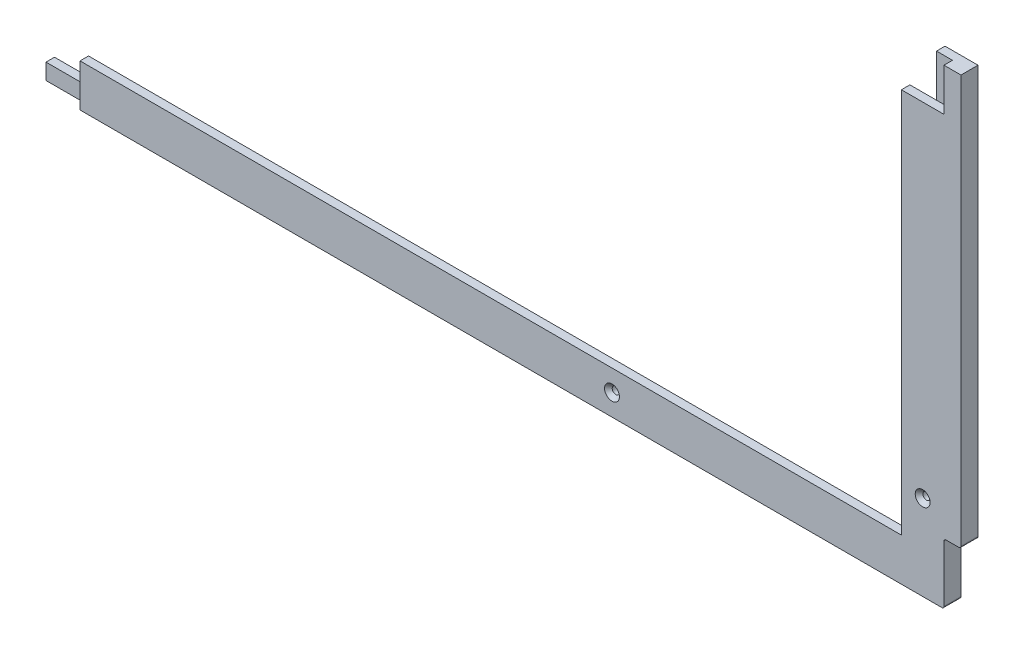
ISO-10303-21;
HEADER;
FILE_DESCRIPTION(('STEP AP214'),'2;1');
FILE_NAME('part.step','',(''),(''),'','','');
FILE_SCHEMA(('AUTOMOTIVE_DESIGN { 1 0 10303 214 1 1 1 1 }'));
ENDSEC;
DATA;
#1=APPLICATION_CONTEXT('core data for automotive mechanical design processes');
#2=APPLICATION_PROTOCOL_DEFINITION('international standard','automotive_design',2000,#1);
#3=PRODUCT_CONTEXT('',#1,'mechanical');
#4=PRODUCT('Part','Part','',(#3));
#5=PRODUCT_RELATED_PRODUCT_CATEGORY('part','',(#4));
#6=PRODUCT_DEFINITION_FORMATION('','',#4);
#7=PRODUCT_DEFINITION_CONTEXT('part definition',#1,'design');
#8=PRODUCT_DEFINITION('design','',#6,#7);
#9=PRODUCT_DEFINITION_SHAPE('','',#8);
#10=(LENGTH_UNIT() NAMED_UNIT(*) SI_UNIT(.MILLI.,.METRE.));
#11=(NAMED_UNIT(*) PLANE_ANGLE_UNIT() SI_UNIT($,.RADIAN.));
#12=(NAMED_UNIT(*) SI_UNIT($,.STERADIAN.) SOLID_ANGLE_UNIT());
#13=UNCERTAINTY_MEASURE_WITH_UNIT(LENGTH_MEASURE(1.E-05),#10,'distance_accuracy_value','');
#14=(GEOMETRIC_REPRESENTATION_CONTEXT(3) GLOBAL_UNCERTAINTY_ASSIGNED_CONTEXT((#13)) GLOBAL_UNIT_ASSIGNED_CONTEXT((#10,
#11,#12)) REPRESENTATION_CONTEXT('',''));
#15=CARTESIAN_POINT('',(0.,0.,0.));
#16=DIRECTION('',(0.,0.,1.));
#17=DIRECTION('',(1.,0.,0.));
#18=AXIS2_PLACEMENT_3D('',#15,#16,#17);
#19=CARTESIAN_POINT('',(0.,0.,8.));
#20=DIRECTION('',(0.,0.,-1.));
#21=DIRECTION('',(-1.,0.,0.));
#22=AXIS2_PLACEMENT_3D('',#19,#20,#21);
#23=PLANE('',#22);
#24=CARTESIAN_POINT('',(406.,-171.25,8.));
#25=DIRECTION('',(0.,0.,1.));
#26=DIRECTION('',(1.,0.,0.));
#27=AXIS2_PLACEMENT_3D('',#24,#25,#26);
#28=CIRCLE('',#27,3.5);
#29=CARTESIAN_POINT('',(409.5,-171.25,8.));
#30=VERTEX_POINT('',#29);
#31=EDGE_CURVE('E252',#30,#30,#28,.T.);
#32=ORIENTED_EDGE('',*,*,#31,.F.);
#33=EDGE_LOOP('',(#32));
#34=FACE_BOUND('',#33,.T.);
#35=CARTESIAN_POINT('',(260.,-201.25,8.));
#36=DIRECTION('',(0.,0.,1.));
#37=DIRECTION('',(1.,0.,0.));
#38=AXIS2_PLACEMENT_3D('',#35,#36,#37);
#39=CIRCLE('',#38,3.5);
#40=CARTESIAN_POINT('',(263.5,-201.25,8.));
#41=VERTEX_POINT('',#40);
#42=EDGE_CURVE('E245',#41,#41,#39,.T.);
#43=ORIENTED_EDGE('',*,*,#42,.F.);
#44=EDGE_LOOP('',(#43));
#45=FACE_BOUND('',#44,.T.);
#46=DIRECTION('',(1.,0.,0.));
#47=VECTOR('',#46,1.);
#48=CARTESIAN_POINT('',(416.,-182.75,8.00000000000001));
#49=LINE('',#48,#47);
#50=CARTESIAN_POINT('',(417.,-182.75,8.00000000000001));
#51=VERTEX_POINT('',#50);
#52=CARTESIAN_POINT('',(423.,-182.75,8.00000000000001));
#53=VERTEX_POINT('',#52);
#54=EDGE_CURVE('E326',#51,#53,#49,.T.);
#55=ORIENTED_EDGE('',*,*,#54,.T.);
#56=CARTESIAN_POINT('',(423.,-181.75,8.00000000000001));
#57=DIRECTION('',(0.,0.,-1.));
#58=DIRECTION('',(-1.,0.,0.));
#59=AXIS2_PLACEMENT_3D('',#56,#57,#58);
#60=CIRCLE('',#59,1.);
#61=CARTESIAN_POINT('',(424.,-181.75,8.00000000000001));
#62=VERTEX_POINT('',#61);
#63=EDGE_CURVE('E317',#53,#62,#60,.F.);
#64=ORIENTED_EDGE('',*,*,#63,.T.);
#65=DIRECTION('',(0.,1.,0.));
#66=VECTOR('',#65,1.);
#67=CARTESIAN_POINT('',(424.,10.,8.00000000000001));
#68=LINE('',#67,#66);
#69=CARTESIAN_POINT('',(424.,10.,8.00000000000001));
#70=VERTEX_POINT('',#69);
#71=EDGE_CURVE('E182',#62,#70,#68,.T.);
#72=ORIENTED_EDGE('',*,*,#71,.T.);
#73=DIRECTION('',(-1.,0.,0.));
#74=VECTOR('',#73,1.);
#75=CARTESIAN_POINT('',(416.,10.,8.00000000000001));
#76=LINE('',#75,#74);
#77=CARTESIAN_POINT('',(416.,10.,8.00000000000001));
#78=VERTEX_POINT('',#77);
#79=EDGE_CURVE('E179',#70,#78,#76,.T.);
#80=ORIENTED_EDGE('',*,*,#79,.T.);
#81=DIRECTION('',(0.,-1.,0.));
#82=VECTOR('',#81,1.);
#83=CARTESIAN_POINT('',(416.,10.,8.00000000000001));
#84=LINE('',#83,#82);
#85=CARTESIAN_POINT('',(416.,-10.,8.00000000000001));
#86=VERTEX_POINT('',#85);
#87=EDGE_CURVE('E194',#78,#86,#84,.T.);
#88=ORIENTED_EDGE('',*,*,#87,.T.);
#89=DIRECTION('',(-1.,0.,0.));
#90=VECTOR('',#89,1.);
#91=CARTESIAN_POINT('',(416.,-10.,7.99999999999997));
#92=LINE('',#91,#90);
#93=CARTESIAN_POINT('',(396.,-10.,7.99999999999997));
#94=VERTEX_POINT('',#93);
#95=EDGE_CURVE('E234',#86,#94,#92,.T.);
#96=ORIENTED_EDGE('',*,*,#95,.T.);
#97=DIRECTION('',(0.,1.,0.));
#98=VECTOR('',#97,1.);
#99=CARTESIAN_POINT('',(396.,-191.25,8.));
#100=LINE('',#99,#98);
#101=CARTESIAN_POINT('',(396.,-191.25,8.));
#102=VERTEX_POINT('',#101);
#103=EDGE_CURVE('E273',#102,#94,#100,.T.);
#104=ORIENTED_EDGE('',*,*,#103,.F.);
#105=DIRECTION('',(1.,0.,0.));
#106=VECTOR('',#105,1.);
#107=CARTESIAN_POINT('',(-396.,-191.25,8.));
#108=LINE('',#107,#106);
#109=CARTESIAN_POINT('',(9.99999999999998,-191.25,8.));
#110=VERTEX_POINT('',#109);
#111=EDGE_CURVE('E276',#110,#102,#108,.T.);
#112=ORIENTED_EDGE('',*,*,#111,.F.);
#113=DIRECTION('',(0.,1.,0.));
#114=VECTOR('',#113,1.);
#115=CARTESIAN_POINT('',(9.99999999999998,-211.25,8.));
#116=LINE('',#115,#114);
#117=CARTESIAN_POINT('',(9.99999999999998,-211.25,8.));
#118=VERTEX_POINT('',#117);
#119=EDGE_CURVE('E208',#118,#110,#116,.T.);
#120=ORIENTED_EDGE('',*,*,#119,.F.);
#121=DIRECTION('',(1.,0.,0.));
#122=VECTOR('',#121,1.);
#123=CARTESIAN_POINT('',(-416.,-211.25,8.));
#124=LINE('',#123,#122);
#125=CARTESIAN_POINT('',(415.,-211.25,8.));
#126=VERTEX_POINT('',#125);
#127=EDGE_CURVE('E284',#118,#126,#124,.T.);
#128=ORIENTED_EDGE('',*,*,#127,.T.);
#129=CARTESIAN_POINT('',(415.,-210.25,8.));
#130=DIRECTION('',(0.,0.,-1.));
#131=DIRECTION('',(-1.,0.,0.));
#132=AXIS2_PLACEMENT_3D('',#129,#130,#131);
#133=CIRCLE('',#132,1.);
#134=CARTESIAN_POINT('',(416.,-210.25,8.));
#135=VERTEX_POINT('',#134);
#136=EDGE_CURVE('E292',#126,#135,#133,.F.);
#137=ORIENTED_EDGE('',*,*,#136,.T.);
#138=DIRECTION('',(0.,1.,0.));
#139=VECTOR('',#138,1.);
#140=CARTESIAN_POINT('',(416.,-211.25,8.));
#141=LINE('',#140,#139);
#142=CARTESIAN_POINT('',(416.,-183.75,8.));
#143=VERTEX_POINT('',#142);
#144=EDGE_CURVE('E282',#135,#143,#141,.T.);
#145=ORIENTED_EDGE('',*,*,#144,.T.);
#146=CARTESIAN_POINT('',(417.,-183.75,8.00000000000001));
#147=DIRECTION('',(0.,0.,-1.));
#148=DIRECTION('',(-1.,0.,0.));
#149=AXIS2_PLACEMENT_3D('',#146,#147,#148);
#150=CIRCLE('',#149,1.);
#151=EDGE_CURVE('E11',#143,#51,#150,.T.);
#152=ORIENTED_EDGE('',*,*,#151,.T.);
#153=EDGE_LOOP('',(#55,#64,#72,#80,#88,#96,#104,#112,#120,#128,#137,#145,#152));
#154=FACE_BOUND('',#153,.T.);
#155=ADVANCED_FACE('F34',(#34,#45,#154),#23,.F.);
#156=CARTESIAN_POINT('',(396.,-191.25,8.));
#157=DIRECTION('',(-1.,0.,0.));
#158=DIRECTION('',(0.,0.,1.));
#159=AXIS2_PLACEMENT_3D('',#156,#157,#158);
#160=PLANE('',#159);
#161=ORIENTED_EDGE('',*,*,#103,.T.);
#162=DIRECTION('',(0.,0.,-1.));
#163=VECTOR('',#162,1.);
#164=CARTESIAN_POINT('',(396.,-10.,8.00000000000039));
#165=LINE('',#164,#163);
#166=CARTESIAN_POINT('',(396.,-10.,4.));
#167=VERTEX_POINT('',#166);
#168=EDGE_CURVE('E242',#94,#167,#165,.T.);
#169=ORIENTED_EDGE('',*,*,#168,.T.);
#170=DIRECTION('',(0.,-1.,0.));
#171=VECTOR('',#170,1.);
#172=CARTESIAN_POINT('',(396.,-191.25,4.));
#173=LINE('',#172,#171);
#174=CARTESIAN_POINT('',(396.,-191.25,4.));
#175=VERTEX_POINT('',#174);
#176=EDGE_CURVE('E271',#167,#175,#173,.T.);
#177=ORIENTED_EDGE('',*,*,#176,.T.);
#178=DIRECTION('',(0.,0.,-1.));
#179=VECTOR('',#178,1.);
#180=CARTESIAN_POINT('',(396.,-191.25,8.));
#181=LINE('',#180,#179);
#182=EDGE_CURVE('E278',#102,#175,#181,.T.);
#183=ORIENTED_EDGE('',*,*,#182,.F.);
#184=EDGE_LOOP('',(#161,#169,#177,#183));
#185=FACE_BOUND('',#184,.T.);
#186=ADVANCED_FACE('F342',(#185),#160,.T.);
#187=CARTESIAN_POINT('',(0.,0.,0.));
#188=DIRECTION('',(0.,0.,-1.));
#189=DIRECTION('',(-1.,0.,0.));
#190=AXIS2_PLACEMENT_3D('',#187,#188,#189);
#191=PLANE('',#190);
#192=DIRECTION('',(0.,-1.,0.));
#193=VECTOR('',#192,1.);
#194=CARTESIAN_POINT('',(424.,10.,0.));
#195=LINE('',#194,#193);
#196=CARTESIAN_POINT('',(424.,10.,0.));
#197=VERTEX_POINT('',#196);
#198=CARTESIAN_POINT('',(424.,-181.75,0.));
#199=VERTEX_POINT('',#198);
#200=EDGE_CURVE('E166',#197,#199,#195,.T.);
#201=ORIENTED_EDGE('',*,*,#200,.T.);
#202=CARTESIAN_POINT('',(423.,-181.75,0.));
#203=DIRECTION('',(0.,0.,-1.));
#204=DIRECTION('',(-1.,0.,0.));
#205=AXIS2_PLACEMENT_3D('',#202,#203,#204);
#206=CIRCLE('',#205,1.);
#207=CARTESIAN_POINT('',(423.,-182.75,0.));
#208=VERTEX_POINT('',#207);
#209=EDGE_CURVE('E311',#199,#208,#206,.T.);
#210=ORIENTED_EDGE('',*,*,#209,.T.);
#211=DIRECTION('',(-1.,0.,0.));
#212=VECTOR('',#211,1.);
#213=CARTESIAN_POINT('',(416.,-182.75,0.));
#214=LINE('',#213,#212);
#215=CARTESIAN_POINT('',(417.,-182.75,0.));
#216=VERTEX_POINT('',#215);
#217=EDGE_CURVE('E189',#208,#216,#214,.T.);
#218=ORIENTED_EDGE('',*,*,#217,.T.);
#219=CARTESIAN_POINT('',(417.,-183.75,0.));
#220=DIRECTION('',(0.,0.,-1.));
#221=DIRECTION('',(-1.,0.,0.));
#222=AXIS2_PLACEMENT_3D('',#219,#220,#221);
#223=CIRCLE('',#222,1.);
#224=CARTESIAN_POINT('',(416.,-183.75,0.));
#225=VERTEX_POINT('',#224);
#226=EDGE_CURVE('E42',#216,#225,#223,.F.);
#227=ORIENTED_EDGE('',*,*,#226,.T.);
#228=DIRECTION('',(0.,1.,0.));
#229=VECTOR('',#228,1.);
#230=CARTESIAN_POINT('',(416.,-211.25,0.));
#231=LINE('',#230,#229);
#232=CARTESIAN_POINT('',(416.,-210.25,0.));
#233=VERTEX_POINT('',#232);
#234=EDGE_CURVE('E281',#233,#225,#231,.T.);
#235=ORIENTED_EDGE('',*,*,#234,.F.);
#236=CARTESIAN_POINT('',(415.,-210.25,0.));
#237=DIRECTION('',(0.,0.,-1.));
#238=DIRECTION('',(-1.,0.,0.));
#239=AXIS2_PLACEMENT_3D('',#236,#237,#238);
#240=CIRCLE('',#239,1.);
#241=CARTESIAN_POINT('',(415.,-211.25,0.));
#242=VERTEX_POINT('',#241);
#243=EDGE_CURVE('E287',#233,#242,#240,.T.);
#244=ORIENTED_EDGE('',*,*,#243,.T.);
#245=DIRECTION('',(1.,0.,0.));
#246=VECTOR('',#245,1.);
#247=CARTESIAN_POINT('',(-416.,-211.25,0.));
#248=LINE('',#247,#246);
#249=CARTESIAN_POINT('',(-10.,-211.25,0.));
#250=VERTEX_POINT('',#249);
#251=EDGE_CURVE('E285',#250,#242,#248,.T.);
#252=ORIENTED_EDGE('',*,*,#251,.F.);
#253=DIRECTION('',(0.,1.,0.));
#254=VECTOR('',#253,1.);
#255=CARTESIAN_POINT('',(-10.,-211.25,0.));
#256=LINE('',#255,#254);
#257=CARTESIAN_POINT('',(-10.,-203.75,0.));
#258=VERTEX_POINT('',#257);
#259=EDGE_CURVE('E209',#250,#258,#256,.T.);
#260=ORIENTED_EDGE('',*,*,#259,.T.);
#261=DIRECTION('',(-1.,0.,0.));
#262=VECTOR('',#261,1.);
#263=CARTESIAN_POINT('',(408.5,-203.75,0.));
#264=LINE('',#263,#262);
#265=CARTESIAN_POINT('',(408.5,-203.75,0.));
#266=VERTEX_POINT('',#265);
#267=EDGE_CURVE('E262',#266,#258,#264,.T.);
#268=ORIENTED_EDGE('',*,*,#267,.F.);
#269=DIRECTION('',(0.,-1.,0.));
#270=VECTOR('',#269,1.);
#271=CARTESIAN_POINT('',(408.5,203.75,0.));
#272=LINE('',#271,#270);
#273=CARTESIAN_POINT('',(408.5,10.,0.));
#274=VERTEX_POINT('',#273);
#275=EDGE_CURVE('E168',#274,#266,#272,.T.);
#276=ORIENTED_EDGE('',*,*,#275,.F.);
#277=DIRECTION('',(-1.,0.,0.));
#278=VECTOR('',#277,1.);
#279=CARTESIAN_POINT('',(416.,10.,0.));
#280=LINE('',#279,#278);
#281=EDGE_CURVE('E162',#197,#274,#280,.T.);
#282=ORIENTED_EDGE('',*,*,#281,.F.);
#283=EDGE_LOOP('',(#201,#210,#218,#227,#235,#244,#252,#260,#268,#276,#282));
#284=FACE_BOUND('',#283,.T.);
#285=ADVANCED_FACE('F164',(#284),#191,.T.);
#286=CARTESIAN_POINT('',(416.,-211.25,8.));
#287=DIRECTION('',(-1.,0.,0.));
#288=DIRECTION('',(0.,0.,1.));
#289=AXIS2_PLACEMENT_3D('',#286,#287,#288);
#290=PLANE('',#289);
#291=ORIENTED_EDGE('',*,*,#234,.T.);
#292=DIRECTION('',(0.,0.,-1.));
#293=VECTOR('',#292,1.);
#294=CARTESIAN_POINT('',(416.,-183.75,8.));
#295=LINE('',#294,#293);
#296=EDGE_CURVE('E49',#225,#143,#295,.F.);
#297=ORIENTED_EDGE('',*,*,#296,.T.);
#298=ORIENTED_EDGE('',*,*,#144,.F.);
#299=DIRECTION('',(0.,0.,-1.));
#300=VECTOR('',#299,1.);
#301=CARTESIAN_POINT('',(416.,-210.25,8.));
#302=LINE('',#301,#300);
#303=EDGE_CURVE('E297',#135,#233,#302,.T.);
#304=ORIENTED_EDGE('',*,*,#303,.T.);
#305=EDGE_LOOP('',(#291,#297,#298,#304));
#306=FACE_BOUND('',#305,.T.);
#307=ADVANCED_FACE('F322',(#306),#290,.F.);
#308=CARTESIAN_POINT('',(408.5,203.75,4.));
#309=DIRECTION('',(1.,0.,0.));
#310=DIRECTION('',(0.,1.,0.));
#311=AXIS2_PLACEMENT_3D('',#308,#309,#310);
#312=PLANE('',#311);
#313=DIRECTION('',(0.,0.,1.));
#314=VECTOR('',#313,1.);
#315=CARTESIAN_POINT('',(408.5,10.,3.9999999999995));
#316=LINE('',#315,#314);
#317=CARTESIAN_POINT('',(408.5,10.,4.));
#318=VERTEX_POINT('',#317);
#319=EDGE_CURVE('E240',#274,#318,#316,.T.);
#320=ORIENTED_EDGE('',*,*,#319,.F.);
#321=ORIENTED_EDGE('',*,*,#275,.T.);
#322=DIRECTION('',(0.,0.,-1.));
#323=VECTOR('',#322,1.);
#324=CARTESIAN_POINT('',(408.5,-203.75,4.));
#325=LINE('',#324,#323);
#326=CARTESIAN_POINT('',(408.5,-203.75,4.));
#327=VERTEX_POINT('',#326);
#328=EDGE_CURVE('E265',#327,#266,#325,.T.);
#329=ORIENTED_EDGE('',*,*,#328,.F.);
#330=DIRECTION('',(0.,-1.,0.));
#331=VECTOR('',#330,1.);
#332=CARTESIAN_POINT('',(408.5,203.75,4.));
#333=LINE('',#332,#331);
#334=CARTESIAN_POINT('',(408.5,-10.,4.));
#335=VERTEX_POINT('',#334);
#336=EDGE_CURVE('E259',#335,#327,#333,.T.);
#337=ORIENTED_EDGE('',*,*,#336,.F.);
#338=DIRECTION('',(0.,-1.,0.));
#339=VECTOR('',#338,1.);
#340=CARTESIAN_POINT('',(408.5,203.75,4.));
#341=LINE('',#340,#339);
#342=EDGE_CURVE('E237',#318,#335,#341,.T.);
#343=ORIENTED_EDGE('',*,*,#342,.F.);
#344=EDGE_LOOP('',(#320,#321,#329,#337,#343));
#345=FACE_BOUND('',#344,.T.);
#346=ADVANCED_FACE('F363',(#345),#312,.F.);
#347=CARTESIAN_POINT('',(0.,0.,4.));
#348=DIRECTION('',(0.,0.,-1.));
#349=DIRECTION('',(-1.,0.,0.));
#350=AXIS2_PLACEMENT_3D('',#347,#348,#349);
#351=PLANE('',#350);
#352=DIRECTION('',(0.,1.,0.));
#353=VECTOR('',#352,1.);
#354=CARTESIAN_POINT('',(10.,-211.25,4.));
#355=LINE('',#354,#353);
#356=CARTESIAN_POINT('',(10.0000000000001,-203.75,4.));
#357=VERTEX_POINT('',#356);
#358=CARTESIAN_POINT('',(10.,-191.25,4.));
#359=VERTEX_POINT('',#358);
#360=EDGE_CURVE('E218',#357,#359,#355,.T.);
#361=ORIENTED_EDGE('',*,*,#360,.T.);
#362=DIRECTION('',(-1.,0.,0.));
#363=VECTOR('',#362,1.);
#364=CARTESIAN_POINT('',(-396.,-191.25,4.));
#365=LINE('',#364,#363);
#366=EDGE_CURVE('E300',#175,#359,#365,.T.);
#367=ORIENTED_EDGE('',*,*,#366,.F.);
#368=ORIENTED_EDGE('',*,*,#176,.F.);
#369=DIRECTION('',(-1.,0.,0.));
#370=VECTOR('',#369,1.);
#371=CARTESIAN_POINT('',(416.,-10.,4.));
#372=LINE('',#371,#370);
#373=EDGE_CURVE('E231',#335,#167,#372,.T.);
#374=ORIENTED_EDGE('',*,*,#373,.F.);
#375=ORIENTED_EDGE('',*,*,#336,.T.);
#376=DIRECTION('',(-1.,0.,0.));
#377=VECTOR('',#376,1.);
#378=CARTESIAN_POINT('',(408.5,-203.75,4.));
#379=LINE('',#378,#377);
#380=EDGE_CURVE('E261',#327,#357,#379,.T.);
#381=ORIENTED_EDGE('',*,*,#380,.T.);
#382=EDGE_LOOP('',(#361,#367,#368,#374,#375,#381));
#383=FACE_BOUND('',#382,.T.);
#384=CARTESIAN_POINT('',(260.,-201.25,4.));
#385=DIRECTION('',(0.,0.,-1.));
#386=DIRECTION('',(-1.,0.,0.));
#387=AXIS2_PLACEMENT_3D('',#384,#385,#386);
#388=CIRCLE('',#387,1.69999999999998);
#389=CARTESIAN_POINT('',(258.3,-201.25,4.));
#390=VERTEX_POINT('',#389);
#391=EDGE_CURVE('E251',#390,#390,#388,.T.);
#392=ORIENTED_EDGE('',*,*,#391,.F.);
#393=EDGE_LOOP('',(#392));
#394=FACE_BOUND('',#393,.T.);
#395=CARTESIAN_POINT('',(406.,-171.25,4.));
#396=DIRECTION('',(0.,0.,-1.));
#397=DIRECTION('',(-1.,0.,0.));
#398=AXIS2_PLACEMENT_3D('',#395,#396,#397);
#399=CIRCLE('',#398,1.69999999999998);
#400=CARTESIAN_POINT('',(404.3,-171.25,4.));
#401=VERTEX_POINT('',#400);
#402=EDGE_CURVE('E258',#401,#401,#399,.T.);
#403=ORIENTED_EDGE('',*,*,#402,.F.);
#404=EDGE_LOOP('',(#403));
#405=FACE_BOUND('',#404,.T.);
#406=ADVANCED_FACE('F407',(#383,#394,#405),#351,.T.);
#407=CARTESIAN_POINT('',(-396.,-191.25,8.));
#408=DIRECTION('',(0.,1.,0.));
#409=DIRECTION('',(0.,0.,1.));
#410=AXIS2_PLACEMENT_3D('',#407,#408,#409);
#411=PLANE('',#410);
#412=DIRECTION('',(0.,0.,-1.));
#413=VECTOR('',#412,1.);
#414=CARTESIAN_POINT('',(10.,-191.25,8.00000000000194));
#415=LINE('',#414,#413);
#416=EDGE_CURVE('E222',#110,#359,#415,.T.);
#417=ORIENTED_EDGE('',*,*,#416,.F.);
#418=ORIENTED_EDGE('',*,*,#111,.T.);
#419=ORIENTED_EDGE('',*,*,#182,.T.);
#420=ORIENTED_EDGE('',*,*,#366,.T.);
#421=EDGE_LOOP('',(#417,#418,#419,#420));
#422=FACE_BOUND('',#421,.T.);
#423=ADVANCED_FACE('F360',(#422),#411,.T.);
#424=CARTESIAN_POINT('',(-416.,-211.25,8.));
#425=DIRECTION('',(0.,1.,0.));
#426=DIRECTION('',(0.,0.,1.));
#427=AXIS2_PLACEMENT_3D('',#424,#425,#426);
#428=PLANE('',#427);
#429=DIRECTION('',(-1.,0.,0.));
#430=VECTOR('',#429,1.);
#431=CARTESIAN_POINT('',(-10.,-211.25,4.));
#432=LINE('',#431,#430);
#433=CARTESIAN_POINT('',(10.,-211.25,4.));
#434=VERTEX_POINT('',#433);
#435=CARTESIAN_POINT('',(-10.,-211.25,4.));
#436=VERTEX_POINT('',#435);
#437=EDGE_CURVE('E202',#434,#436,#432,.T.);
#438=ORIENTED_EDGE('',*,*,#437,.T.);
#439=DIRECTION('',(0.,0.,-1.));
#440=VECTOR('',#439,1.);
#441=CARTESIAN_POINT('',(-10.,-211.25,0.));
#442=LINE('',#441,#440);
#443=EDGE_CURVE('E205',#436,#250,#442,.T.);
#444=ORIENTED_EDGE('',*,*,#443,.T.);
#445=ORIENTED_EDGE('',*,*,#251,.T.);
#446=DIRECTION('',(0.,0.,-1.));
#447=VECTOR('',#446,1.);
#448=CARTESIAN_POINT('',(415.,-211.25,8.));
#449=LINE('',#448,#447);
#450=EDGE_CURVE('E294',#242,#126,#449,.F.);
#451=ORIENTED_EDGE('',*,*,#450,.T.);
#452=ORIENTED_EDGE('',*,*,#127,.F.);
#453=DIRECTION('',(0.,0.,-1.));
#454=VECTOR('',#453,1.);
#455=CARTESIAN_POINT('',(10.,-211.25,4.));
#456=LINE('',#455,#454);
#457=EDGE_CURVE('E199',#118,#434,#456,.T.);
#458=ORIENTED_EDGE('',*,*,#457,.T.);
#459=EDGE_LOOP('',(#438,#444,#445,#451,#452,#458));
#460=FACE_BOUND('',#459,.T.);
#461=ADVANCED_FACE('F356',(#460),#428,.F.);
#462=CARTESIAN_POINT('',(415.,-210.25,8.));
#463=DIRECTION('',(0.,0.,-1.));
#464=DIRECTION('',(-1.,0.,0.));
#465=AXIS2_PLACEMENT_3D('',#462,#463,#464);
#466=CYLINDRICAL_SURFACE('',#465,1.);
#467=ORIENTED_EDGE('',*,*,#136,.F.);
#468=ORIENTED_EDGE('',*,*,#450,.F.);
#469=ORIENTED_EDGE('',*,*,#243,.F.);
#470=ORIENTED_EDGE('',*,*,#303,.F.);
#471=EDGE_LOOP('',(#467,#468,#469,#470));
#472=FACE_BOUND('',#471,.T.);
#473=ADVANCED_FACE('F359',(#472),#466,.T.);
#474=CARTESIAN_POINT('',(408.5,-203.75,4.));
#475=DIRECTION('',(0.,-1.,0.));
#476=DIRECTION('',(0.,0.,-1.));
#477=AXIS2_PLACEMENT_3D('',#474,#475,#476);
#478=PLANE('',#477);
#479=ORIENTED_EDGE('',*,*,#267,.T.);
#480=DIRECTION('',(0.,0.,1.));
#481=VECTOR('',#480,1.);
#482=CARTESIAN_POINT('',(-10.,-203.75,4.00000000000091));
#483=LINE('',#482,#481);
#484=CARTESIAN_POINT('',(-10.,-203.75,4.));
#485=VERTEX_POINT('',#484);
#486=EDGE_CURVE('E303',#258,#485,#483,.T.);
#487=ORIENTED_EDGE('',*,*,#486,.T.);
#488=DIRECTION('',(1.,0.,0.));
#489=VECTOR('',#488,1.);
#490=CARTESIAN_POINT('',(408.5,-203.75,4.));
#491=LINE('',#490,#489);
#492=EDGE_CURVE('E212',#485,#357,#491,.T.);
#493=ORIENTED_EDGE('',*,*,#492,.T.);
#494=ORIENTED_EDGE('',*,*,#380,.F.);
#495=ORIENTED_EDGE('',*,*,#328,.T.);
#496=EDGE_LOOP('',(#479,#487,#493,#494,#495));
#497=FACE_BOUND('',#496,.T.);
#498=ADVANCED_FACE('F365',(#497),#478,.F.);
#499=CARTESIAN_POINT('',(406.,-171.25,8.));
#500=DIRECTION('',(0.,0.,1.));
#501=DIRECTION('',(1.,0.,0.));
#502=AXIS2_PLACEMENT_3D('',#499,#500,#501);
#503=CYLINDRICAL_SURFACE('',#502,1.69999999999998);
#504=ORIENTED_EDGE('',*,*,#402,.T.);
#505=EDGE_LOOP('',(#504));
#506=FACE_BOUND('',#505,.T.);
#507=CARTESIAN_POINT('',(406.,-171.25,6.2));
#508=DIRECTION('',(0.,0.,1.));
#509=DIRECTION('',(1.,0.,0.));
#510=AXIS2_PLACEMENT_3D('',#507,#508,#509);
#511=CIRCLE('',#510,1.69999999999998);
#512=CARTESIAN_POINT('',(407.7,-171.25,6.2));
#513=VERTEX_POINT('',#512);
#514=EDGE_CURVE('E255',#513,#513,#511,.T.);
#515=ORIENTED_EDGE('',*,*,#514,.T.);
#516=EDGE_LOOP('',(#515));
#517=FACE_BOUND('',#516,.T.);
#518=ADVANCED_FACE('F370',(#506,#517),#503,.F.);
#519=CARTESIAN_POINT('',(406.,-171.25,8.));
#520=DIRECTION('',(0.,0.,1.));
#521=DIRECTION('',(1.,0.,0.));
#522=AXIS2_PLACEMENT_3D('',#519,#520,#521);
#523=CONICAL_SURFACE('',#522,3.5,0.785398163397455);
#524=ORIENTED_EDGE('',*,*,#514,.F.);
#525=EDGE_LOOP('',(#524));
#526=FACE_BOUND('',#525,.T.);
#527=ORIENTED_EDGE('',*,*,#31,.T.);
#528=EDGE_LOOP('',(#527));
#529=FACE_BOUND('',#528,.T.);
#530=ADVANCED_FACE('F417',(#526,#529),#523,.F.);
#531=CARTESIAN_POINT('',(260.,-201.25,8.));
#532=DIRECTION('',(0.,0.,1.));
#533=DIRECTION('',(1.,0.,0.));
#534=AXIS2_PLACEMENT_3D('',#531,#532,#533);
#535=CYLINDRICAL_SURFACE('',#534,1.69999999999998);
#536=ORIENTED_EDGE('',*,*,#391,.T.);
#537=EDGE_LOOP('',(#536));
#538=FACE_BOUND('',#537,.T.);
#539=CARTESIAN_POINT('',(260.,-201.25,6.2));
#540=DIRECTION('',(0.,0.,1.));
#541=DIRECTION('',(1.,0.,0.));
#542=AXIS2_PLACEMENT_3D('',#539,#540,#541);
#543=CIRCLE('',#542,1.69999999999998);
#544=CARTESIAN_POINT('',(261.7,-201.25,6.2));
#545=VERTEX_POINT('',#544);
#546=EDGE_CURVE('E248',#545,#545,#543,.T.);
#547=ORIENTED_EDGE('',*,*,#546,.T.);
#548=EDGE_LOOP('',(#547));
#549=FACE_BOUND('',#548,.T.);
#550=ADVANCED_FACE('F423',(#538,#549),#535,.F.);
#551=CARTESIAN_POINT('',(260.,-201.25,8.));
#552=DIRECTION('',(0.,0.,1.));
#553=DIRECTION('',(1.,0.,0.));
#554=AXIS2_PLACEMENT_3D('',#551,#552,#553);
#555=CONICAL_SURFACE('',#554,3.5,0.785398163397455);
#556=ORIENTED_EDGE('',*,*,#546,.F.);
#557=EDGE_LOOP('',(#556));
#558=FACE_BOUND('',#557,.T.);
#559=ORIENTED_EDGE('',*,*,#42,.T.);
#560=EDGE_LOOP('',(#559));
#561=FACE_BOUND('',#560,.T.);
#562=ADVANCED_FACE('F428',(#558,#561),#555,.F.);
#563=CARTESIAN_POINT('',(416.,10.,4.));
#564=DIRECTION('',(0.,1.,0.));
#565=DIRECTION('',(0.,0.,1.));
#566=AXIS2_PLACEMENT_3D('',#563,#564,#565);
#567=PLANE('',#566);
#568=ORIENTED_EDGE('',*,*,#319,.T.);
#569=DIRECTION('',(-1.,0.,0.));
#570=VECTOR('',#569,1.);
#571=CARTESIAN_POINT('',(416.,10.,4.));
#572=LINE('',#571,#570);
#573=CARTESIAN_POINT('',(416.,10.,4.));
#574=VERTEX_POINT('',#573);
#575=EDGE_CURVE('E171',#574,#318,#572,.T.);
#576=ORIENTED_EDGE('',*,*,#575,.F.);
#577=DIRECTION('',(0.,0.,-1.));
#578=VECTOR('',#577,1.);
#579=CARTESIAN_POINT('',(416.,10.,200.915946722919));
#580=LINE('',#579,#578);
#581=EDGE_CURVE('E183',#78,#574,#580,.T.);
#582=ORIENTED_EDGE('',*,*,#581,.F.);
#583=ORIENTED_EDGE('',*,*,#79,.F.);
#584=DIRECTION('',(0.,0.,-1.));
#585=VECTOR('',#584,1.);
#586=CARTESIAN_POINT('',(424.,10.,200.915946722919));
#587=LINE('',#586,#585);
#588=EDGE_CURVE('E176',#70,#197,#587,.T.);
#589=ORIENTED_EDGE('',*,*,#588,.T.);
#590=ORIENTED_EDGE('',*,*,#281,.T.);
#591=EDGE_LOOP('',(#568,#576,#582,#583,#589,#590));
#592=FACE_BOUND('',#591,.T.);
#593=ADVANCED_FACE('F177',(#592),#567,.T.);
#594=CARTESIAN_POINT('',(416.,-10.,4.));
#595=DIRECTION('',(0.,0.,1.));
#596=DIRECTION('',(1.,0.,0.));
#597=AXIS2_PLACEMENT_3D('',#594,#595,#596);
#598=PLANE('',#597);
#599=ORIENTED_EDGE('',*,*,#342,.T.);
#600=CARTESIAN_POINT('',(416.,-10.,4.));
#601=VERTEX_POINT('',#600);
#602=EDGE_CURVE('E232',#601,#335,#372,.T.);
#603=ORIENTED_EDGE('',*,*,#602,.F.);
#604=DIRECTION('',(0.,1.,0.));
#605=VECTOR('',#604,1.);
#606=CARTESIAN_POINT('',(416.,-10.,4.));
#607=LINE('',#606,#605);
#608=EDGE_CURVE('E172',#601,#574,#607,.T.);
#609=ORIENTED_EDGE('',*,*,#608,.T.);
#610=ORIENTED_EDGE('',*,*,#575,.T.);
#611=EDGE_LOOP('',(#599,#603,#609,#610));
#612=FACE_BOUND('',#611,.T.);
#613=ADVANCED_FACE('F388',(#612),#598,.T.);
#614=CARTESIAN_POINT('',(416.,-10.,7.99999999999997));
#615=DIRECTION('',(0.,1.,0.));
#616=DIRECTION('',(0.,0.,1.));
#617=AXIS2_PLACEMENT_3D('',#614,#615,#616);
#618=PLANE('',#617);
#619=ORIENTED_EDGE('',*,*,#95,.F.);
#620=DIRECTION('',(0.,0.,-1.));
#621=VECTOR('',#620,1.);
#622=CARTESIAN_POINT('',(416.,-10.,7.99999999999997));
#623=LINE('',#622,#621);
#624=EDGE_CURVE('E224',#86,#601,#623,.T.);
#625=ORIENTED_EDGE('',*,*,#624,.T.);
#626=ORIENTED_EDGE('',*,*,#602,.T.);
#627=ORIENTED_EDGE('',*,*,#373,.T.);
#628=ORIENTED_EDGE('',*,*,#168,.F.);
#629=EDGE_LOOP('',(#619,#625,#626,#627,#628));
#630=FACE_BOUND('',#629,.T.);
#631=ADVANCED_FACE('F395',(#630),#618,.T.);
#632=CARTESIAN_POINT('',(-10.,-211.25,0.));
#633=DIRECTION('',(1.,0.,0.));
#634=DIRECTION('',(0.,0.,-1.));
#635=AXIS2_PLACEMENT_3D('',#632,#633,#634);
#636=PLANE('',#635);
#637=ORIENTED_EDGE('',*,*,#259,.F.);
#638=ORIENTED_EDGE('',*,*,#443,.F.);
#639=DIRECTION('',(0.,1.,0.));
#640=VECTOR('',#639,1.);
#641=CARTESIAN_POINT('',(-10.,-211.25,4.));
#642=LINE('',#641,#640);
#643=EDGE_CURVE('E213',#436,#485,#642,.T.);
#644=ORIENTED_EDGE('',*,*,#643,.T.);
#645=ORIENTED_EDGE('',*,*,#486,.F.);
#646=EDGE_LOOP('',(#637,#638,#644,#645));
#647=FACE_BOUND('',#646,.T.);
#648=ADVANCED_FACE('F456',(#647),#636,.F.);
#649=CARTESIAN_POINT('',(-10.,-211.25,4.));
#650=DIRECTION('',(0.,0.,-1.));
#651=DIRECTION('',(-1.,0.,0.));
#652=AXIS2_PLACEMENT_3D('',#649,#650,#651);
#653=PLANE('',#652);
#654=ORIENTED_EDGE('',*,*,#643,.F.);
#655=ORIENTED_EDGE('',*,*,#437,.F.);
#656=EDGE_CURVE('E216',#434,#357,#355,.T.);
#657=ORIENTED_EDGE('',*,*,#656,.T.);
#658=ORIENTED_EDGE('',*,*,#492,.F.);
#659=EDGE_LOOP('',(#654,#655,#657,#658));
#660=FACE_BOUND('',#659,.T.);
#661=ADVANCED_FACE('F461',(#660),#653,.F.);
#662=CARTESIAN_POINT('',(10.,-211.25,4.));
#663=DIRECTION('',(1.,0.,0.));
#664=DIRECTION('',(0.,0.,-1.));
#665=AXIS2_PLACEMENT_3D('',#662,#663,#664);
#666=PLANE('',#665);
#667=ORIENTED_EDGE('',*,*,#416,.T.);
#668=ORIENTED_EDGE('',*,*,#360,.F.);
#669=ORIENTED_EDGE('',*,*,#656,.F.);
#670=ORIENTED_EDGE('',*,*,#457,.F.);
#671=ORIENTED_EDGE('',*,*,#119,.T.);
#672=EDGE_LOOP('',(#667,#668,#669,#670,#671));
#673=FACE_BOUND('',#672,.T.);
#674=ADVANCED_FACE('F405',(#673),#666,.F.);
#675=CARTESIAN_POINT('',(416.,10.,200.915946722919));
#676=DIRECTION('',(-1.,0.,0.));
#677=DIRECTION('',(0.,0.,1.));
#678=AXIS2_PLACEMENT_3D('',#675,#676,#677);
#679=PLANE('',#678);
#680=ORIENTED_EDGE('',*,*,#581,.T.);
#681=ORIENTED_EDGE('',*,*,#608,.F.);
#682=ORIENTED_EDGE('',*,*,#624,.F.);
#683=ORIENTED_EDGE('',*,*,#87,.F.);
#684=EDGE_LOOP('',(#680,#681,#682,#683));
#685=FACE_BOUND('',#684,.T.);
#686=ADVANCED_FACE('F392',(#685),#679,.T.);
#687=CARTESIAN_POINT('',(416.,-182.75,200.915946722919));
#688=DIRECTION('',(0.,-1.,0.));
#689=DIRECTION('',(0.,0.,-1.));
#690=AXIS2_PLACEMENT_3D('',#687,#688,#689);
#691=PLANE('',#690);
#692=ORIENTED_EDGE('',*,*,#217,.F.);
#693=DIRECTION('',(0.,0.,-1.));
#694=VECTOR('',#693,1.);
#695=CARTESIAN_POINT('',(423.,-182.75,200.915946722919));
#696=LINE('',#695,#694);
#697=EDGE_CURVE('E57',#208,#53,#696,.F.);
#698=ORIENTED_EDGE('',*,*,#697,.T.);
#699=ORIENTED_EDGE('',*,*,#54,.F.);
#700=DIRECTION('',(0.,0.,-1.));
#701=VECTOR('',#700,1.);
#702=CARTESIAN_POINT('',(417.,-182.75,200.915946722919));
#703=LINE('',#702,#701);
#704=EDGE_CURVE('E313',#51,#216,#703,.T.);
#705=ORIENTED_EDGE('',*,*,#704,.T.);
#706=EDGE_LOOP('',(#692,#698,#699,#705));
#707=FACE_BOUND('',#706,.T.);
#708=ADVANCED_FACE('F328',(#707),#691,.T.);
#709=CARTESIAN_POINT('',(424.,10.,200.915946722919));
#710=DIRECTION('',(1.,0.,0.));
#711=DIRECTION('',(0.,0.,-1.));
#712=AXIS2_PLACEMENT_3D('',#709,#710,#711);
#713=PLANE('',#712);
#714=ORIENTED_EDGE('',*,*,#71,.F.);
#715=DIRECTION('',(0.,0.,-1.));
#716=VECTOR('',#715,1.);
#717=CARTESIAN_POINT('',(424.,-181.75,200.915946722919));
#718=LINE('',#717,#716);
#719=EDGE_CURVE('E188',#62,#199,#718,.T.);
#720=ORIENTED_EDGE('',*,*,#719,.T.);
#721=ORIENTED_EDGE('',*,*,#200,.F.);
#722=ORIENTED_EDGE('',*,*,#588,.F.);
#723=EDGE_LOOP('',(#714,#720,#721,#722));
#724=FACE_BOUND('',#723,.T.);
#725=ADVANCED_FACE('F186',(#724),#713,.T.);
#726=CARTESIAN_POINT('',(423.,-181.75,200.915946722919));
#727=DIRECTION('',(0.,0.,-1.));
#728=DIRECTION('',(-1.,0.,0.));
#729=AXIS2_PLACEMENT_3D('',#726,#727,#728);
#730=CYLINDRICAL_SURFACE('',#729,1.);
#731=ORIENTED_EDGE('',*,*,#63,.F.);
#732=ORIENTED_EDGE('',*,*,#697,.F.);
#733=ORIENTED_EDGE('',*,*,#209,.F.);
#734=ORIENTED_EDGE('',*,*,#719,.F.);
#735=EDGE_LOOP('',(#731,#732,#733,#734));
#736=FACE_BOUND('',#735,.T.);
#737=ADVANCED_FACE('F333',(#736),#730,.T.);
#738=CARTESIAN_POINT('',(417.,-183.75,200.915946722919));
#739=DIRECTION('',(0.,0.,-1.));
#740=DIRECTION('',(-1.,0.,0.));
#741=AXIS2_PLACEMENT_3D('',#738,#739,#740);
#742=CYLINDRICAL_SURFACE('',#741,1.);
#743=ORIENTED_EDGE('',*,*,#151,.F.);
#744=ORIENTED_EDGE('',*,*,#296,.F.);
#745=ORIENTED_EDGE('',*,*,#226,.F.);
#746=ORIENTED_EDGE('',*,*,#704,.F.);
#747=EDGE_LOOP('',(#743,#744,#745,#746));
#748=FACE_BOUND('',#747,.T.);
#749=ADVANCED_FACE('F36',(#748),#742,.F.);
#750=CLOSED_SHELL('',(#155,#186,#285,#307,#346,#406,#423,#461,#473,#498,#518,#530,#550,#562,
#593,#613,#631,#648,#661,#674,#686,#708,#725,#737,#749));
#751=MANIFOLD_SOLID_BREP('B2',#750);
#752=ADVANCED_BREP_SHAPE_REPRESENTATION('',(#18,#751),#14);
#753=SHAPE_DEFINITION_REPRESENTATION(#9,#752);
ENDSEC;
END-ISO-10303-21;
